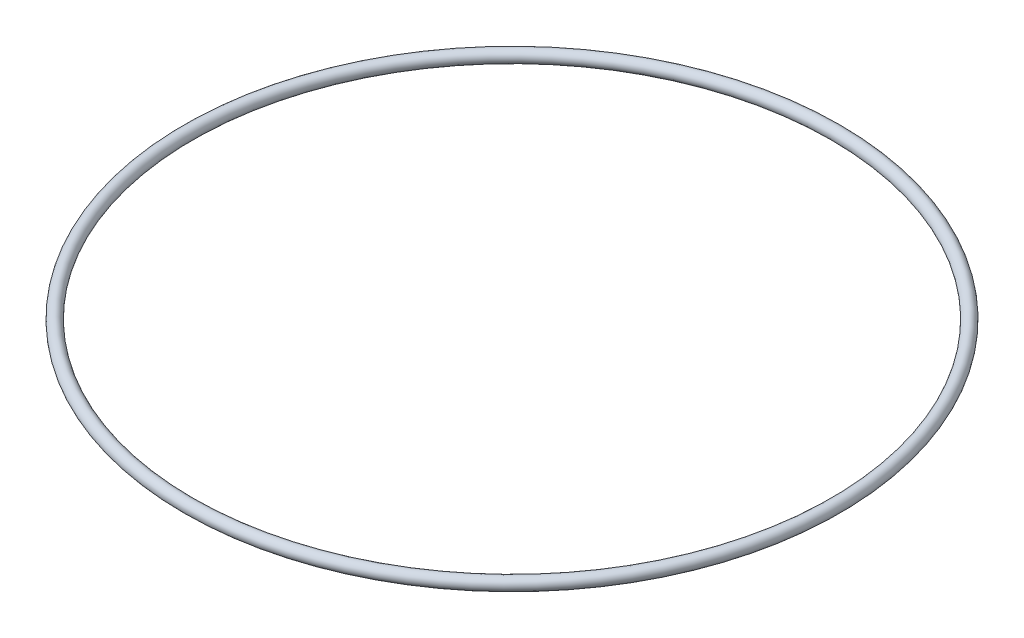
from build123d import *

# Parameters (mm, degrees)
ESQUISSE1_R = 2.5


with BuildPart() as part:
    # Esquisse1 → Base-R_volution (revolve)
    with BuildSketch(Plane.XY, mode=Mode.PRIVATE) as base_r_volution_sk:
        with Locations((131.25, 0)):
            Circle(ESQUISSE1_R)
    revolve(base_r_volution_sk.sketch.rotate(Axis((0, 2.5, 0), (0, -1, 0)), 90), axis=Axis((0, 2.5, 0), (0, -1, 0)))


solid = part.part
